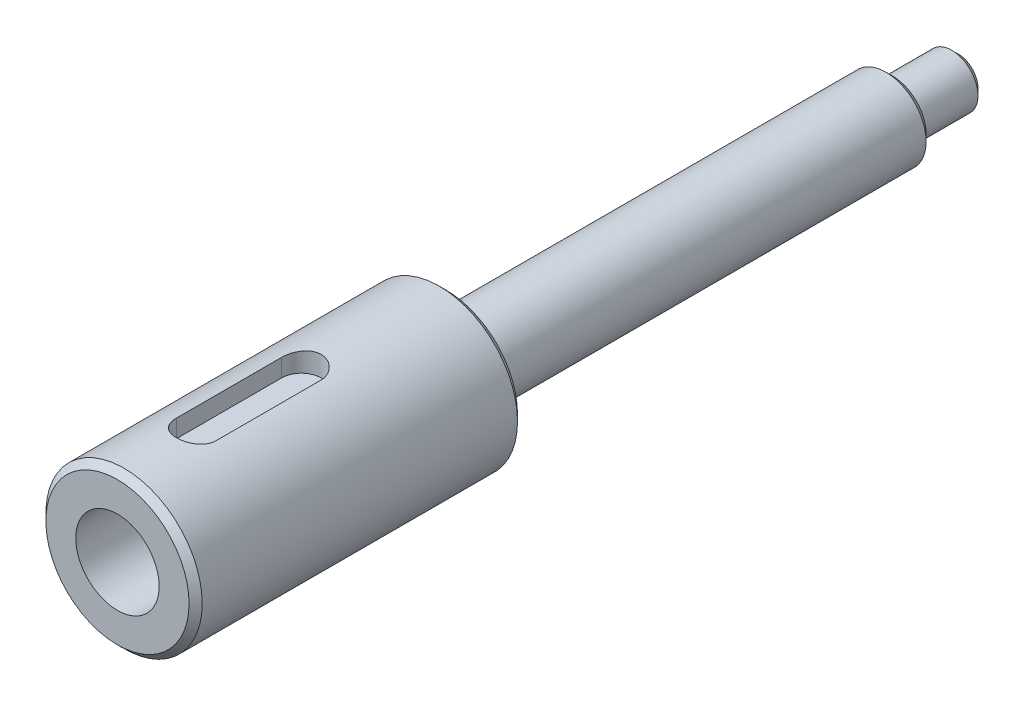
ISO-10303-21;
HEADER;
FILE_DESCRIPTION(('STEP AP214'),'2;1');
FILE_NAME('part.step','',(''),(''),'','','');
FILE_SCHEMA(('AUTOMOTIVE_DESIGN { 1 0 10303 214 1 1 1 1 }'));
ENDSEC;
DATA;
#1=APPLICATION_CONTEXT('core data for automotive mechanical design processes');
#2=APPLICATION_PROTOCOL_DEFINITION('international standard','automotive_design',2000,#1);
#3=PRODUCT_CONTEXT('',#1,'mechanical');
#4=PRODUCT('Part','Part','',(#3));
#5=PRODUCT_RELATED_PRODUCT_CATEGORY('part','',(#4));
#6=PRODUCT_DEFINITION_FORMATION('','',#4);
#7=PRODUCT_DEFINITION_CONTEXT('part definition',#1,'design');
#8=PRODUCT_DEFINITION('design','',#6,#7);
#9=PRODUCT_DEFINITION_SHAPE('','',#8);
#10=(LENGTH_UNIT() NAMED_UNIT(*) SI_UNIT(.MILLI.,.METRE.));
#11=(NAMED_UNIT(*) PLANE_ANGLE_UNIT() SI_UNIT($,.RADIAN.));
#12=(NAMED_UNIT(*) SI_UNIT($,.STERADIAN.) SOLID_ANGLE_UNIT());
#13=UNCERTAINTY_MEASURE_WITH_UNIT(LENGTH_MEASURE(1.E-05),#10,'distance_accuracy_value','');
#14=(GEOMETRIC_REPRESENTATION_CONTEXT(3) GLOBAL_UNCERTAINTY_ASSIGNED_CONTEXT((#13)) GLOBAL_UNIT_ASSIGNED_CONTEXT((#10,
#11,#12)) REPRESENTATION_CONTEXT('',''));
#15=CARTESIAN_POINT('',(0.,0.,0.));
#16=DIRECTION('',(0.,0.,1.));
#17=DIRECTION('',(1.,0.,0.));
#18=AXIS2_PLACEMENT_3D('',#15,#16,#17);
#19=CARTESIAN_POINT('',(0.,0.,-39.));
#20=DIRECTION('',(0.,0.,1.));
#21=DIRECTION('',(1.,0.,0.));
#22=AXIS2_PLACEMENT_3D('',#19,#20,#21);
#23=CYLINDRICAL_SURFACE('',#22,3.05);
#24=CARTESIAN_POINT('',(0.,0.,-33.5));
#25=DIRECTION('',(0.,0.,-1.));
#26=DIRECTION('',(-1.,0.,0.));
#27=AXIS2_PLACEMENT_3D('',#24,#25,#26);
#28=CIRCLE('',#27,3.05);
#29=CARTESIAN_POINT('',(-3.04999999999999,0.,-33.5));
#30=VERTEX_POINT('',#29);
#31=EDGE_CURVE('E12',#30,#30,#28,.F.);
#32=ORIENTED_EDGE('',*,*,#31,.T.);
#33=EDGE_LOOP('',(#32));
#34=FACE_BOUND('',#33,.T.);
#35=CARTESIAN_POINT('',(0.,0.,0.));
#36=DIRECTION('',(0.,0.,1.));
#37=DIRECTION('',(1.,0.,0.));
#38=AXIS2_PLACEMENT_3D('',#35,#36,#37);
#39=CIRCLE('',#38,3.05);
#40=CARTESIAN_POINT('',(3.04999999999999,0.,0.));
#41=VERTEX_POINT('',#40);
#42=EDGE_CURVE('E136',#41,#41,#39,.F.);
#43=ORIENTED_EDGE('',*,*,#42,.T.);
#44=EDGE_LOOP('',(#43));
#45=FACE_BOUND('',#44,.T.);
#46=ADVANCED_FACE('F53',(#34,#45),#23,.T.);
#47=CARTESIAN_POINT('',(0.,0.,0.));
#48=DIRECTION('',(0.,0.,1.));
#49=DIRECTION('',(1.,0.,0.));
#50=AXIS2_PLACEMENT_3D('',#47,#48,#49);
#51=PLANE('',#50);
#52=CARTESIAN_POINT('',(0.,0.,0.));
#53=DIRECTION('',(0.,0.,1.));
#54=DIRECTION('',(1.,0.,0.));
#55=AXIS2_PLACEMENT_3D('',#52,#53,#54);
#56=CIRCLE('',#55,5.45);
#57=CARTESIAN_POINT('',(5.44999999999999,0.,0.));
#58=VERTEX_POINT('',#57);
#59=EDGE_CURVE('E155',#58,#58,#56,.F.);
#60=ORIENTED_EDGE('',*,*,#59,.T.);
#61=EDGE_LOOP('',(#60));
#62=FACE_BOUND('',#61,.T.);
#63=ORIENTED_EDGE('',*,*,#42,.F.);
#64=EDGE_LOOP('',(#63));
#65=FACE_BOUND('',#64,.T.);
#66=ADVANCED_FACE('F220',(#62,#65),#51,.F.);
#67=CARTESIAN_POINT('',(0.,0.,25.));
#68=DIRECTION('',(0.,0.,-1.));
#69=DIRECTION('',(-1.,0.,0.));
#70=AXIS2_PLACEMENT_3D('',#67,#68,#69);
#71=CYLINDRICAL_SURFACE('',#70,5.95);
#72=CARTESIAN_POINT('',(-5.94999999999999,0.,3.5));
#73=CARTESIAN_POINT('',(-5.94999941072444,-0.0419493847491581,3.49999821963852));
#74=CARTESIAN_POINT('',(-5.94955168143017,-0.0839249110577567,3.49646863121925));
#75=CARTESIAN_POINT('',(-5.94780866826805,-0.166707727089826,3.4824442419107));
#76=CARTESIAN_POINT('',(-5.94651250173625,-0.207513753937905,3.47194218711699));
#77=CARTESIAN_POINT('',(-5.94321862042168,-0.28674715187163,3.44428737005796));
#78=CARTESIAN_POINT('',(-5.94122138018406,-0.325176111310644,3.42713910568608));
#79=CARTESIAN_POINT('',(-5.93674742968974,-0.398603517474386,3.38668852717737));
#80=CARTESIAN_POINT('',(-5.93427080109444,-0.433602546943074,3.36338726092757));
#81=CARTESIAN_POINT('',(-5.92909905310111,-0.499379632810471,3.3111527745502));
#82=CARTESIAN_POINT('',(-5.92640290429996,-0.530135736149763,3.28219200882));
#83=CARTESIAN_POINT('',(-5.92110427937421,-0.586364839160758,3.21951975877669));
#84=CARTESIAN_POINT('',(-5.91850180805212,-0.611837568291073,3.18580803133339));
#85=CARTESIAN_POINT('',(-5.91367506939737,-0.656858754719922,3.11444796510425));
#86=CARTESIAN_POINT('',(-5.91145212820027,-0.67638661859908,3.07678653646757));
#87=CARTESIAN_POINT('',(-5.90764973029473,-0.70883223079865,2.99868608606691));
#88=CARTESIAN_POINT('',(-5.90607024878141,-0.72175023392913,2.95824717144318));
#89=CARTESIAN_POINT('',(-5.90374344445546,-0.740542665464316,2.87596762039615));
#90=CARTESIAN_POINT('',(-5.90299174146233,-0.746454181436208,2.83413558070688));
#91=CARTESIAN_POINT('',(-5.90239220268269,-0.751180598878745,2.75006694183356));
#92=CARTESIAN_POINT('',(-5.90254432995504,-0.749995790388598,2.70783035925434));
#93=CARTESIAN_POINT('',(-5.90373125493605,-0.740593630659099,2.62441018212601));
#94=CARTESIAN_POINT('',(-5.90476092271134,-0.732417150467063,2.58322189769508));
#95=CARTESIAN_POINT('',(-5.90757890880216,-0.709327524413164,2.50280673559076));
#96=CARTESIAN_POINT('',(-5.90936724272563,-0.694414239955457,2.46357989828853));
#97=CARTESIAN_POINT('',(-5.91350687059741,-0.658230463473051,2.38807426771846));
#98=CARTESIAN_POINT('',(-5.91585973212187,-0.63694222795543,2.35180406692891));
#99=CARTESIAN_POINT('',(-5.92086209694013,-0.588625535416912,2.28333544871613));
#100=CARTESIAN_POINT('',(-5.92351161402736,-0.561596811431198,2.25113722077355));
#101=CARTESIAN_POINT('',(-5.92883155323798,-0.502339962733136,2.19148932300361));
#102=CARTESIAN_POINT('',(-5.93150199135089,-0.470076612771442,2.16407463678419));
#103=CARTESIAN_POINT('',(-5.93654545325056,-0.401387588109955,2.11504447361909));
#104=CARTESIAN_POINT('',(-5.93891847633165,-0.364961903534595,2.09342901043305));
#105=CARTESIAN_POINT('',(-5.94310124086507,-0.28895509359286,2.05661078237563));
#106=CARTESIAN_POINT('',(-5.94491078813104,-0.249372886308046,2.04141022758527));
#107=CARTESIAN_POINT('',(-5.94776095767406,-0.16818997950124,2.0178811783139));
#108=CARTESIAN_POINT('',(-5.94880161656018,-0.126589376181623,2.00955235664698));
#109=CARTESIAN_POINT('',(-5.94999199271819,-0.0428530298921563,2.00004858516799));
#110=CARTESIAN_POINT('',(-5.95014771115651,-0.000722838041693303,1.99882544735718));
#111=CARTESIAN_POINT('',(-5.94956686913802,0.0831419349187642,2.00344056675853));
#112=CARTESIAN_POINT('',(-5.94883032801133,0.124876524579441,2.00927867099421));
#113=CARTESIAN_POINT('',(-5.94655146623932,0.2066230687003,2.0278105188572));
#114=CARTESIAN_POINT('',(-5.94501184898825,0.246640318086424,2.04048126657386));
#115=CARTESIAN_POINT('',(-5.94129919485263,0.323981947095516,2.07229480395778));
#116=CARTESIAN_POINT('',(-5.93912613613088,0.361306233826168,2.091437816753));
#117=CARTESIAN_POINT('',(-5.93437388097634,0.432417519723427,2.13576893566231));
#118=CARTESIAN_POINT('',(-5.93179261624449,0.466184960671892,2.16098818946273));
#119=CARTESIAN_POINT('',(-5.92651911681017,0.529024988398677,2.21671186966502));
#120=CARTESIAN_POINT('',(-5.92382687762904,0.558097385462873,2.24721650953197));
#121=CARTESIAN_POINT('',(-5.918616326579,0.610893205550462,2.31285739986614));
#122=CARTESIAN_POINT('',(-5.91609911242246,0.63458467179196,2.34801945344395));
#123=CARTESIAN_POINT('',(-5.91154172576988,0.675725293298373,2.42185193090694));
#124=CARTESIAN_POINT('',(-5.90950154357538,0.693174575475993,2.46052228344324));
#125=CARTESIAN_POINT('',(-5.90613670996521,0.721283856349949,2.54017083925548));
#126=CARTESIAN_POINT('',(-5.90481016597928,0.731961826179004,2.5811426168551));
#127=CARTESIAN_POINT('',(-5.90301738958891,0.74628322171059,2.66431548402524));
#128=CARTESIAN_POINT('',(-5.90255111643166,0.749926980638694,2.70651651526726));
#129=CARTESIAN_POINT('',(-5.90253287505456,0.750070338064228,2.79063200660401));
#130=CARTESIAN_POINT('',(-5.9029744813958,0.746620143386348,2.8325463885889));
#131=CARTESIAN_POINT('',(-5.90470842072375,0.732779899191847,2.91519443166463));
#132=CARTESIAN_POINT('',(-5.90600075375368,0.72238984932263,2.95592809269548));
#133=CARTESIAN_POINT('',(-5.90928853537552,0.694980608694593,3.03505152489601));
#134=CARTESIAN_POINT('',(-5.91128372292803,0.677963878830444,3.07344216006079));
#135=CARTESIAN_POINT('',(-5.91575283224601,0.637789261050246,3.14683117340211));
#136=CARTESIAN_POINT('',(-5.91822676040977,0.61463129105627,3.18182950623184));
#137=CARTESIAN_POINT('',(-5.92339557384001,0.562645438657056,3.24769703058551));
#138=CARTESIAN_POINT('',(-5.92609184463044,0.533780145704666,3.27853658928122));
#139=CARTESIAN_POINT('',(-5.93138933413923,0.471277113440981,3.33495337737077));
#140=CARTESIAN_POINT('',(-5.93399053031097,0.43763825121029,3.36052936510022));
#141=CARTESIAN_POINT('',(-5.93881590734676,0.366393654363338,3.40577736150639));
#142=CARTESIAN_POINT('',(-5.94103859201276,0.328773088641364,3.42542616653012));
#143=CARTESIAN_POINT('',(-5.94484136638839,0.250759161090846,3.45809917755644));
#144=CARTESIAN_POINT('',(-5.94642215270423,0.210368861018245,3.4711305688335));
#145=CARTESIAN_POINT('',(-5.94838273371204,0.141475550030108,3.48708581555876));
#146=CARTESIAN_POINT('',(-5.94898624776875,0.113406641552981,3.49192165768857));
#147=CARTESIAN_POINT('',(-5.94979507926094,0.0568958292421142,3.4983793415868));
#148=CARTESIAN_POINT('',(-5.95000039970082,0.028453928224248,3.50000120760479));
#149=CARTESIAN_POINT('',(-5.94999999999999,0.,3.5));
#150=B_SPLINE_CURVE_WITH_KNOTS('',3,(#72,#73,#74,#75,#76,#77,#78,#79,#80,#81,#82,#83,#84,#85,
#86,#87,#88,#89,#90,#91,#92,#93,#94,#95,#96,#97,#98,#99,#100,#101,#102,#103,#104,#105,#106,#107,
#108,#109,#110,#111,#112,#113,#114,#115,#116,#117,#118,#119,#120,#121,#122,#123,#124,#125,#126,
#127,#128,#129,#130,#131,#132,#133,#134,#135,#136,#137,#138,#139,#140,#141,#142,#143,#144,#145,
#146,#147,#148,#149),.UNSPECIFIED.,.T.,.F.,(4,2,2,2,2,2,2,2,2,2,2,2,2,2,2,2,2,2,2,2,2,2,2,2,2,2,
2,2,2,2,2,2,2,2,2,2,2,2,4),(0.,0.125744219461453,0.251619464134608,0.377409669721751,
0.503178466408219,0.629575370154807,0.755978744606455,0.882815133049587,1.00964663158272,
1.13580372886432,1.26195566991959,1.38737516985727,1.51279725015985,1.63857171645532,
1.76435203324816,1.89101682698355,2.01768192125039,2.14439061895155,2.27109328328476,
2.39693568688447,2.52277536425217,2.64819413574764,2.77361723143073,2.89969748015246,
3.0257828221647,3.15259845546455,3.2794115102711,3.4058865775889,3.53235565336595,
3.65793273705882,3.78350982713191,3.90904032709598,4.03457250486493,4.16095656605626,
4.28737040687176,4.41427289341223,4.5410372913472,4.62632922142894,4.71162050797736),.UNSPECIFIED.);
#151=CARTESIAN_POINT('',(-5.94999999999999,0.,3.5));
#152=VERTEX_POINT('',#151);
#153=EDGE_CURVE('E118',#152,#152,#150,.T.);
#154=ORIENTED_EDGE('',*,*,#153,.T.);
#155=EDGE_LOOP('',(#154));
#156=FACE_BOUND('',#155,.T.);
#157=DIRECTION('',(0.,0.,-1.));
#158=VECTOR('',#157,1.);
#159=CARTESIAN_POINT('',(1.5,5.75782076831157,25.));
#160=LINE('',#159,#158);
#161=CARTESIAN_POINT('',(1.5,5.75782076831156,11.));
#162=VERTEX_POINT('',#161);
#163=CARTESIAN_POINT('',(1.49999999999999,5.75782076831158,19.));
#164=VERTEX_POINT('',#163);
#165=EDGE_CURVE('E158',#162,#164,#160,.F.);
#166=ORIENTED_EDGE('',*,*,#165,.T.);
#167=CARTESIAN_POINT('',(0.,5.95,20.5));
#168=CARTESIAN_POINT('',(-0.0828533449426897,5.94999861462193,20.4999977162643));
#169=CARTESIAN_POINT('',(-0.165732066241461,5.94825219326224,20.4931122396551));
#170=CARTESIAN_POINT('',(-0.329112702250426,5.94145464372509,20.4657944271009));
#171=CARTESIAN_POINT('',(-0.409613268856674,5.93640167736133,20.445354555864));
#172=CARTESIAN_POINT('',(-0.565854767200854,5.92355035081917,20.3916266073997));
#173=CARTESIAN_POINT('',(-0.641601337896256,5.91575531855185,20.3583540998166));
#174=CARTESIAN_POINT('',(-0.786437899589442,5.89824924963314,20.2799605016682));
#175=CARTESIAN_POINT('',(-0.855527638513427,5.88853814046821,20.2348389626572));
#176=CARTESIAN_POINT('',(-0.986534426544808,5.86802636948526,20.1330313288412));
#177=CARTESIAN_POINT('',(-1.04829241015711,5.85720867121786,20.0761439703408));
#178=CARTESIAN_POINT('',(-1.1614999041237,5.83581565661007,19.9528503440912));
#179=CARTESIAN_POINT('',(-1.2129482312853,5.82524036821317,19.8864429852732));
#180=CARTESIAN_POINT('',(-1.30482744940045,5.80535748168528,19.7447550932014));
#181=CARTESIAN_POINT('',(-1.3450797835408,5.79607149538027,19.6693554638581));
#182=CARTESIAN_POINT('',(-1.41227590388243,5.78006730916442,19.5125876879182));
#183=CARTESIAN_POINT('',(-1.43922185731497,5.77334869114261,19.4312205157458));
#184=CARTESIAN_POINT('',(-1.47849647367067,5.76341514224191,19.2665780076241));
#185=CARTESIAN_POINT('',(-1.49111143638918,5.76013169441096,19.1833751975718));
#186=CARTESIAN_POINT('',(-1.50225785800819,5.75723520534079,19.0159744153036));
#187=CARTESIAN_POINT('',(-1.50079164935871,5.75762155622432,18.9317766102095));
#188=CARTESIAN_POINT('',(-1.4840456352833,5.76195945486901,18.766975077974));
#189=CARTESIAN_POINT('',(-1.46910763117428,5.76582278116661,18.6863339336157));
#190=CARTESIAN_POINT('',(-1.42638757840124,5.77653865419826,18.5287409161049));
#191=CARTESIAN_POINT('',(-1.3986046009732,5.7833914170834,18.4517893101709));
#192=CARTESIAN_POINT('',(-1.33069355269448,5.79939458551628,18.3028463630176));
#193=CARTESIAN_POINT('',(-1.29044195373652,5.808567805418,18.2309138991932));
#194=CARTESIAN_POINT('',(-1.19882262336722,5.82816549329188,18.094702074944));
#195=CARTESIAN_POINT('',(-1.14745291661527,5.83859018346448,18.0304240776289));
#196=CARTESIAN_POINT('',(-1.03328788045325,5.85988714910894,17.9093877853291));
#197=CARTESIAN_POINT('',(-0.970204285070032,5.87076363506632,17.8529017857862));
#198=CARTESIAN_POINT('',(-0.835329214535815,5.89146611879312,17.7512583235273));
#199=CARTESIAN_POINT('',(-0.763537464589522,5.90129208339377,17.706101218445));
#200=CARTESIAN_POINT('',(-0.612891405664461,5.91883666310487,17.628294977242));
#201=CARTESIAN_POINT('',(-0.534012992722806,5.92654769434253,17.5956906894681));
#202=CARTESIAN_POINT('',(-0.371656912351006,5.93893847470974,17.5442809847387));
#203=CARTESIAN_POINT('',(-0.288180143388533,5.94361881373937,17.5254728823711));
#204=CARTESIAN_POINT('',(-0.121324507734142,5.94933333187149,17.502606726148));
#205=CARTESIAN_POINT('',(-0.0379995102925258,5.95045913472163,17.4981779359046));
#206=CARTESIAN_POINT('',(0.128201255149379,5.94919899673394,17.5031784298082));
#207=CARTESIAN_POINT('',(0.211077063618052,5.94681337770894,17.5126064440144));
#208=CARTESIAN_POINT('',(0.372734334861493,5.93885722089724,17.5447475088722));
#209=CARTESIAN_POINT('',(0.451558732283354,5.93333533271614,17.5672577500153));
#210=CARTESIAN_POINT('',(0.604308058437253,5.919729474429,17.6246921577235));
#211=CARTESIAN_POINT('',(0.678232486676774,5.9116452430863,17.6596175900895));
#212=CARTESIAN_POINT('',(0.820554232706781,5.89359258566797,17.7416056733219));
#213=CARTESIAN_POINT('',(0.888828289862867,5.88359289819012,17.7888752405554));
#214=CARTESIAN_POINT('',(1.01660653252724,5.86286691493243,17.8939458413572));
#215=CARTESIAN_POINT('',(1.07610917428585,5.85214049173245,17.9517487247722));
#216=CARTESIAN_POINT('',(1.18618757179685,5.83083925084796,18.0779676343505));
#217=CARTESIAN_POINT('',(1.23650306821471,5.8202749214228,18.146612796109));
#218=CARTESIAN_POINT('',(1.32490101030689,5.80079254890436,18.2915904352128));
#219=CARTESIAN_POINT('',(1.36298399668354,5.79187443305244,18.3679225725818));
#220=CARTESIAN_POINT('',(1.42555153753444,5.7767931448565,18.5257005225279));
#221=CARTESIAN_POINT('',(1.45011659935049,5.77061370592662,18.6071127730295));
#222=CARTESIAN_POINT('',(1.48516081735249,5.76169510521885,18.7730917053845));
#223=CARTESIAN_POINT('',(1.49564311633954,5.75895517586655,18.8576576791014));
#224=CARTESIAN_POINT('',(1.50205796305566,5.7572850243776,19.0248932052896));
#225=CARTESIAN_POINT('',(1.4984067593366,5.75824580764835,19.1075459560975));
#226=CARTESIAN_POINT('',(1.47761248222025,5.76361643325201,19.2710164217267));
#227=CARTESIAN_POINT('',(1.46046968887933,5.76802620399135,19.3518341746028));
#228=CARTESIAN_POINT('',(1.41340795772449,5.77973666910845,19.5088791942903));
#229=CARTESIAN_POINT('',(1.38356833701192,5.78701939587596,19.5851316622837));
#230=CARTESIAN_POINT('',(1.31202256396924,5.80365744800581,19.7316028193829));
#231=CARTESIAN_POINT('',(1.27031473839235,5.81301306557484,19.8018206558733));
#232=CARTESIAN_POINT('',(1.17491686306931,5.83305252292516,19.9362377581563));
#233=CARTESIAN_POINT('',(1.12093857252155,5.84376499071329,20.000228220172));
#234=CARTESIAN_POINT('',(1.00309206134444,5.86514161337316,20.118378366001));
#235=CARTESIAN_POINT('',(0.939221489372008,5.8758057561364,20.1725357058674));
#236=CARTESIAN_POINT('',(0.801977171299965,5.89611968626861,20.2704603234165));
#237=CARTESIAN_POINT('',(0.728449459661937,5.90574705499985,20.3140168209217));
#238=CARTESIAN_POINT('',(0.574878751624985,5.92266516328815,20.388081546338));
#239=CARTESIAN_POINT('',(0.494840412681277,5.92995755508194,20.4185990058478));
#240=CARTESIAN_POINT('',(0.345802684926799,5.94032242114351,20.4612563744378));
#241=CARTESIAN_POINT('',(0.277505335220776,5.94392640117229,20.4757535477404));
#242=CARTESIAN_POINT('',(0.139477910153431,5.9487656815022,20.4951259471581));
#243=CARTESIAN_POINT('',(0.069747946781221,5.95000116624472,20.5000019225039));
#244=CARTESIAN_POINT('',(0.,5.95,20.5));
#245=B_SPLINE_CURVE_WITH_KNOTS('',3,(#167,#168,#169,#170,#171,#172,#173,#174,#175,#176,#177,
#178,#179,#180,#181,#182,#183,#184,#185,#186,#187,#188,#189,#190,#191,#192,#193,#194,#195,#196,
#197,#198,#199,#200,#201,#202,#203,#204,#205,#206,#207,#208,#209,#210,#211,#212,#213,#214,#215,
#216,#217,#218,#219,#220,#221,#222,#223,#224,#225,#226,#227,#228,#229,#230,#231,#232,#233,#234,
#235,#236,#237,#238,#239,#240,#241,#242,#243,#244),.UNSPECIFIED.,.T.,.F.,(4,2,2,2,2,2,2,2,2,2,2,
2,2,2,2,2,2,2,2,2,2,2,2,2,2,2,2,2,2,2,2,2,2,2,2,2,2,2,4),(0.,0.248304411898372,
0.496746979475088,0.744889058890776,0.993040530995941,1.24585216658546,1.49869279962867,
1.75536063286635,2.01198664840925,2.26339038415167,2.51475247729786,2.75991115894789,
3.00508756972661,3.25277516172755,3.50050679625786,3.75542631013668,4.01035387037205,
4.26618395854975,4.52196423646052,4.77109516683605,5.02020326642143,5.26554880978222,
5.51091937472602,5.76070124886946,6.01052703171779,6.26659631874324,6.52265428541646,
6.77717029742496,7.03162950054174,7.27865240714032,7.5256701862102,7.77116699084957,
8.01669842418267,8.2687364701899,8.5208345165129,8.77759696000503,9.03417731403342,
9.24322224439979,9.45225089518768),.UNSPECIFIED.);
#246=CARTESIAN_POINT('',(-1.5,5.75782076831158,19.));
#247=VERTEX_POINT('',#246);
#248=EDGE_CURVE('E189',#164,#247,#245,.T.);
#249=ORIENTED_EDGE('',*,*,#248,.T.);
#250=DIRECTION('',(0.,0.,-1.));
#251=VECTOR('',#250,1.);
#252=CARTESIAN_POINT('',(-1.49999999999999,5.75782076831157,25.));
#253=LINE('',#252,#251);
#254=CARTESIAN_POINT('',(-1.5,5.75782076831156,11.));
#255=VERTEX_POINT('',#254);
#256=EDGE_CURVE('E168',#247,#255,#253,.T.);
#257=ORIENTED_EDGE('',*,*,#256,.T.);
#258=CARTESIAN_POINT('',(-1.5,5.75782076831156,11.));
#259=CARTESIAN_POINT('',(-1.50000051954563,5.75781794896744,10.9585175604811));
#260=CARTESIAN_POINT('',(-1.49827811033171,5.75826963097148,10.9170556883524));
#261=CARTESIAN_POINT('',(-1.49141196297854,5.76005287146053,10.8344422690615));
#262=CARTESIAN_POINT('',(-1.48626880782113,5.76138428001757,10.7932906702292));
#263=CARTESIAN_POINT('',(-1.46578353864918,5.76664453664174,10.6709191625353));
#264=CARTESIAN_POINT('',(-1.44538528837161,5.77183974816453,10.5905405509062));
#265=CARTESIAN_POINT('',(-1.39176749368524,5.78500082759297,10.4344906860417));
#266=CARTESIAN_POINT('',(-1.35854927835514,5.79296640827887,10.3588189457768));
#267=CARTESIAN_POINT('',(-1.28027492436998,5.81076604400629,10.2140837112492));
#268=CARTESIAN_POINT('',(-1.23521552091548,5.82060061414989,10.1450220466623));
#269=CARTESIAN_POINT('',(-1.13347307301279,5.84127381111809,10.013968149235));
#270=CARTESIAN_POINT('',(-1.0765752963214,5.85212860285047,9.95214521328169));
#271=CARTESIAN_POINT('',(-0.953228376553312,5.87347999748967,9.83880588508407));
#272=CARTESIAN_POINT('',(-0.886777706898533,5.88397654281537,9.78729114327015));
#273=CARTESIAN_POINT('',(-0.745045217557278,5.90360822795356,9.69533814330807));
#274=CARTESIAN_POINT('',(-0.669651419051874,5.91272192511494,9.65506751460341));
#275=CARTESIAN_POINT('',(-0.512900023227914,5.92837481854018,9.58783762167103));
#276=CARTESIAN_POINT('',(-0.431543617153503,5.93491452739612,9.56087570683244));
#277=CARTESIAN_POINT('',(-0.266949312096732,5.94456823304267,9.52157211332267));
#278=CARTESIAN_POINT('',(-0.183784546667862,5.94774993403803,9.50894108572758));
#279=CARTESIAN_POINT('',(-0.0164577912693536,5.95056519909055,9.49774920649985));
#280=CARTESIAN_POINT('',(0.0677040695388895,5.95019921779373,9.49918655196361));
#281=CARTESIAN_POINT('',(0.232624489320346,5.9460105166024,9.51588359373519));
#282=CARTESIAN_POINT('',(0.313416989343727,5.94226599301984,9.53083062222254));
#283=CARTESIAN_POINT('',(0.471307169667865,5.93183220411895,9.57361969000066));
#284=CARTESIAN_POINT('',(0.548404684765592,5.92514280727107,9.60146230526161));
#285=CARTESIAN_POINT('',(0.697538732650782,5.90945163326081,9.6695038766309));
#286=CARTESIAN_POINT('',(0.769522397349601,5.90042922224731,9.70981375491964));
#287=CARTESIAN_POINT('',(0.905811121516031,5.8810502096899,9.80156060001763));
#288=CARTESIAN_POINT('',(0.970114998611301,5.87069340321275,9.85299927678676));
#289=CARTESIAN_POINT('',(1.09107879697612,5.8494381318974,9.96721055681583));
#290=CARTESIAN_POINT('',(1.1474809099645,5.83853260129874,10.0302551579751));
#291=CARTESIAN_POINT('',(1.24898346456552,5.81766568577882,10.1650402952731));
#292=CARTESIAN_POINT('',(1.29408080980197,5.80770455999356,10.2367832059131));
#293=CARTESIAN_POINT('',(1.37186606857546,5.78982652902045,10.3874524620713));
#294=CARTESIAN_POINT('',(1.4044839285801,5.78192124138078,10.4664163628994));
#295=CARTESIAN_POINT('',(1.45585909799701,5.76920154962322,10.628908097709));
#296=CARTESIAN_POINT('',(1.47463713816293,5.76438252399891,10.7124289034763));
#297=CARTESIAN_POINT('',(1.49078909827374,5.760213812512,10.8305627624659));
#298=CARTESIAN_POINT('',(1.49424374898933,5.75931782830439,10.8643797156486));
#299=CARTESIAN_POINT('',(1.49884662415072,5.75812155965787,10.9321257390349));
#300=CARTESIAN_POINT('',(1.49999857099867,5.75782031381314,10.966054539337));
#301=CARTESIAN_POINT('',(1.5,5.75782076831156,11.));
#302=B_SPLINE_CURVE_WITH_KNOTS('',3,(#258,#259,#260,#261,#262,#263,#264,#265,#266,#267,#268,
#269,#270,#271,#272,#273,#274,#275,#276,#277,#278,#279,#280,#281,#282,#283,#284,#285,#286,#287,
#288,#289,#290,#291,#292,#293,#294,#295,#296,#297,#298,#299,#300,#301),.UNSPECIFIED.,.F.,.F.,(4,
2,2,2,2,2,2,2,2,2,2,2,2,2,2,2,2,2,2,2,2,4),(0.,0.124368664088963,0.248716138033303,
0.49669459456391,0.74464734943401,0.992668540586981,1.24565730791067,1.49868654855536,
1.75530791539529,2.01187815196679,2.26317037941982,2.51443040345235,2.76002011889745,
3.00562080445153,3.25347273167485,3.50136276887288,3.75604692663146,4.01080076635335,
4.26696438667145,4.52274351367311,4.62469085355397,4.72647325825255),.UNSPECIFIED.);
#303=EDGE_CURVE('E161',#255,#162,#302,.T.);
#304=ORIENTED_EDGE('',*,*,#303,.T.);
#305=EDGE_LOOP('',(#166,#249,#257,#304));
#306=FACE_BOUND('',#305,.T.);
#307=CARTESIAN_POINT('',(0.,0.,24.5));
#308=DIRECTION('',(0.,0.,1.));
#309=DIRECTION('',(1.,0.,0.));
#310=AXIS2_PLACEMENT_3D('',#307,#308,#309);
#311=CIRCLE('',#310,5.95);
#312=CARTESIAN_POINT('',(5.95,0.,24.5));
#313=VERTEX_POINT('',#312);
#314=EDGE_CURVE('E152',#313,#313,#311,.F.);
#315=ORIENTED_EDGE('',*,*,#314,.T.);
#316=EDGE_LOOP('',(#315));
#317=FACE_BOUND('',#316,.T.);
#318=CARTESIAN_POINT('',(0.,0.,0.5));
#319=DIRECTION('',(0.,0.,1.));
#320=DIRECTION('',(1.,0.,0.));
#321=AXIS2_PLACEMENT_3D('',#318,#319,#320);
#322=CIRCLE('',#321,5.95);
#323=CARTESIAN_POINT('',(5.94999999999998,0.,0.5));
#324=VERTEX_POINT('',#323);
#325=EDGE_CURVE('E149',#324,#324,#322,.T.);
#326=ORIENTED_EDGE('',*,*,#325,.T.);
#327=EDGE_LOOP('',(#326));
#328=FACE_BOUND('',#327,.T.);
#329=ADVANCED_FACE('F55',(#156,#306,#317,#328),#71,.T.);
#330=CARTESIAN_POINT('',(0.,0.,25.));
#331=DIRECTION('',(0.,0.,1.));
#332=DIRECTION('',(1.,0.,0.));
#333=AXIS2_PLACEMENT_3D('',#330,#331,#332);
#334=PLANE('',#333);
#335=CARTESIAN_POINT('',(0.,0.,25.));
#336=DIRECTION('',(0.,0.,1.));
#337=DIRECTION('',(1.,0.,0.));
#338=AXIS2_PLACEMENT_3D('',#335,#336,#337);
#339=CIRCLE('',#338,3.175);
#340=CARTESIAN_POINT('',(3.17500000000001,0.,25.));
#341=VERTEX_POINT('',#340);
#342=EDGE_CURVE('E111',#341,#341,#339,.T.);
#343=ORIENTED_EDGE('',*,*,#342,.F.);
#344=EDGE_LOOP('',(#343));
#345=FACE_BOUND('',#344,.T.);
#346=CARTESIAN_POINT('',(0.,0.,25.));
#347=DIRECTION('',(0.,0.,1.));
#348=DIRECTION('',(1.,0.,0.));
#349=AXIS2_PLACEMENT_3D('',#346,#347,#348);
#350=CIRCLE('',#349,5.45);
#351=CARTESIAN_POINT('',(5.45000000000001,0.,25.));
#352=VERTEX_POINT('',#351);
#353=EDGE_CURVE('E146',#352,#352,#350,.T.);
#354=ORIENTED_EDGE('',*,*,#353,.T.);
#355=EDGE_LOOP('',(#354));
#356=FACE_BOUND('',#355,.T.);
#357=ADVANCED_FACE('F230',(#345,#356),#334,.T.);
#358=CARTESIAN_POINT('',(0.,0.,25.));
#359=DIRECTION('',(0.,0.,-1.));
#360=DIRECTION('',(-1.,0.,0.));
#361=AXIS2_PLACEMENT_3D('',#358,#359,#360);
#362=CONICAL_SURFACE('',#361,5.45,0.785398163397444);
#363=ORIENTED_EDGE('',*,*,#314,.F.);
#364=EDGE_LOOP('',(#363));
#365=FACE_BOUND('',#364,.T.);
#366=ORIENTED_EDGE('',*,*,#353,.F.);
#367=EDGE_LOOP('',(#366));
#368=FACE_BOUND('',#367,.T.);
#369=ADVANCED_FACE('F232',(#365,#368),#362,.T.);
#370=CARTESIAN_POINT('',(0.,0.,0.5));
#371=DIRECTION('',(0.,0.,1.));
#372=DIRECTION('',(1.,0.,0.));
#373=AXIS2_PLACEMENT_3D('',#370,#371,#372);
#374=CONICAL_SURFACE('',#373,5.95,0.785398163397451);
#375=ORIENTED_EDGE('',*,*,#59,.F.);
#376=EDGE_LOOP('',(#375));
#377=FACE_BOUND('',#376,.T.);
#378=ORIENTED_EDGE('',*,*,#325,.F.);
#379=EDGE_LOOP('',(#378));
#380=FACE_BOUND('',#379,.T.);
#381=ADVANCED_FACE('F186',(#377,#380),#374,.T.);
#382=CARTESIAN_POINT('',(0.,4.39999999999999,19.));
#383=DIRECTION('',(0.,1.,0.));
#384=DIRECTION('',(0.,0.,1.));
#385=AXIS2_PLACEMENT_3D('',#382,#383,#384);
#386=CYLINDRICAL_SURFACE('',#385,1.5);
#387=DIRECTION('',(0.,1.,0.));
#388=VECTOR('',#387,1.);
#389=CARTESIAN_POINT('',(1.49999999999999,4.39999999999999,19.));
#390=LINE('',#389,#388);
#391=CARTESIAN_POINT('',(1.49999999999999,4.39999999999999,19.));
#392=VERTEX_POINT('',#391);
#393=EDGE_CURVE('E78',#392,#164,#390,.T.);
#394=ORIENTED_EDGE('',*,*,#393,.F.);
#395=CARTESIAN_POINT('',(0.,4.39999999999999,19.));
#396=DIRECTION('',(0.,1.,0.));
#397=DIRECTION('',(0.,0.,1.));
#398=AXIS2_PLACEMENT_3D('',#395,#396,#397);
#399=CIRCLE('',#398,1.5);
#400=CARTESIAN_POINT('',(-1.49999999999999,4.4,19.));
#401=VERTEX_POINT('',#400);
#402=EDGE_CURVE('E115',#401,#392,#399,.T.);
#403=ORIENTED_EDGE('',*,*,#402,.F.);
#404=DIRECTION('',(0.,1.,0.));
#405=VECTOR('',#404,1.);
#406=CARTESIAN_POINT('',(-1.49999999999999,4.4,19.));
#407=LINE('',#406,#405);
#408=EDGE_CURVE('E133',#401,#247,#407,.T.);
#409=ORIENTED_EDGE('',*,*,#408,.T.);
#410=ORIENTED_EDGE('',*,*,#248,.F.);
#411=EDGE_LOOP('',(#394,#403,#409,#410));
#412=FACE_BOUND('',#411,.T.);
#413=ADVANCED_FACE('F182',(#412),#386,.F.);
#414=CARTESIAN_POINT('',(-1.49999999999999,4.4,19.));
#415=DIRECTION('',(-1.,0.,0.));
#416=DIRECTION('',(0.,0.,1.));
#417=AXIS2_PLACEMENT_3D('',#414,#415,#416);
#418=PLANE('',#417);
#419=ORIENTED_EDGE('',*,*,#408,.F.);
#420=DIRECTION('',(0.,0.,1.));
#421=VECTOR('',#420,1.);
#422=CARTESIAN_POINT('',(-1.49999999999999,4.4,19.));
#423=LINE('',#422,#421);
#424=CARTESIAN_POINT('',(-1.5,4.4,11.));
#425=VERTEX_POINT('',#424);
#426=EDGE_CURVE('E130',#425,#401,#423,.T.);
#427=ORIENTED_EDGE('',*,*,#426,.F.);
#428=DIRECTION('',(0.,1.,0.));
#429=VECTOR('',#428,1.);
#430=CARTESIAN_POINT('',(-1.5,4.4,11.));
#431=LINE('',#430,#429);
#432=EDGE_CURVE('E137',#425,#255,#431,.T.);
#433=ORIENTED_EDGE('',*,*,#432,.T.);
#434=ORIENTED_EDGE('',*,*,#256,.F.);
#435=EDGE_LOOP('',(#419,#427,#433,#434));
#436=FACE_BOUND('',#435,.T.);
#437=ADVANCED_FACE('F176',(#436),#418,.F.);
#438=CARTESIAN_POINT('',(0.,4.40000000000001,11.));
#439=DIRECTION('',(0.,1.,0.));
#440=DIRECTION('',(0.,0.,1.));
#441=AXIS2_PLACEMENT_3D('',#438,#439,#440);
#442=CYLINDRICAL_SURFACE('',#441,1.5);
#443=ORIENTED_EDGE('',*,*,#432,.F.);
#444=CARTESIAN_POINT('',(0.,4.40000000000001,11.));
#445=DIRECTION('',(0.,1.,0.));
#446=DIRECTION('',(0.,0.,1.));
#447=AXIS2_PLACEMENT_3D('',#444,#445,#446);
#448=CIRCLE('',#447,1.5);
#449=CARTESIAN_POINT('',(1.5,4.39999999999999,11.));
#450=VERTEX_POINT('',#449);
#451=EDGE_CURVE('E127',#450,#425,#448,.T.);
#452=ORIENTED_EDGE('',*,*,#451,.F.);
#453=DIRECTION('',(0.,1.,0.));
#454=VECTOR('',#453,1.);
#455=CARTESIAN_POINT('',(1.5,4.39999999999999,11.));
#456=LINE('',#455,#454);
#457=EDGE_CURVE('E140',#450,#162,#456,.T.);
#458=ORIENTED_EDGE('',*,*,#457,.T.);
#459=ORIENTED_EDGE('',*,*,#303,.F.);
#460=EDGE_LOOP('',(#443,#452,#458,#459));
#461=FACE_BOUND('',#460,.T.);
#462=ADVANCED_FACE('F170',(#461),#442,.F.);
#463=CARTESIAN_POINT('',(1.49999999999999,4.39999999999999,19.));
#464=DIRECTION('',(1.,0.,0.));
#465=DIRECTION('',(0.,0.,-1.));
#466=AXIS2_PLACEMENT_3D('',#463,#464,#465);
#467=PLANE('',#466);
#468=ORIENTED_EDGE('',*,*,#457,.F.);
#469=DIRECTION('',(0.,0.,-1.));
#470=VECTOR('',#469,1.);
#471=CARTESIAN_POINT('',(1.49999999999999,4.39999999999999,19.));
#472=LINE('',#471,#470);
#473=EDGE_CURVE('E124',#392,#450,#472,.T.);
#474=ORIENTED_EDGE('',*,*,#473,.F.);
#475=ORIENTED_EDGE('',*,*,#393,.T.);
#476=ORIENTED_EDGE('',*,*,#165,.F.);
#477=EDGE_LOOP('',(#468,#474,#475,#476));
#478=FACE_BOUND('',#477,.T.);
#479=ADVANCED_FACE('F175',(#478),#467,.F.);
#480=CARTESIAN_POINT('',(0.,4.39999999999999,19.));
#481=DIRECTION('',(0.,1.,0.));
#482=DIRECTION('',(0.,0.,1.));
#483=AXIS2_PLACEMENT_3D('',#480,#481,#482);
#484=PLANE('',#483);
#485=ORIENTED_EDGE('',*,*,#402,.T.);
#486=ORIENTED_EDGE('',*,*,#473,.T.);
#487=ORIENTED_EDGE('',*,*,#451,.T.);
#488=ORIENTED_EDGE('',*,*,#426,.T.);
#489=EDGE_LOOP('',(#485,#486,#487,#488));
#490=FACE_BOUND('',#489,.T.);
#491=ADVANCED_FACE('F181',(#490),#484,.T.);
#492=CARTESIAN_POINT('',(0.,0.,25.));
#493=DIRECTION('',(0.,0.,1.));
#494=DIRECTION('',(1.,0.,0.));
#495=AXIS2_PLACEMENT_3D('',#492,#493,#494);
#496=CYLINDRICAL_SURFACE('',#495,3.175);
#497=CARTESIAN_POINT('',(0.,0.,3.5));
#498=DIRECTION('',(0.,0.,1.));
#499=DIRECTION('',(1.,0.,0.));
#500=AXIS2_PLACEMENT_3D('',#497,#498,#499);
#501=CIRCLE('',#500,3.175);
#502=CARTESIAN_POINT('',(-3.17500000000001,0.,3.5));
#503=VERTEX_POINT('',#502);
#504=EDGE_CURVE('E109',#503,#503,#501,.T.);
#505=ORIENTED_EDGE('',*,*,#504,.F.);
#506=EDGE_LOOP('',(#505));
#507=FACE_BOUND('',#506,.T.);
#508=ORIENTED_EDGE('',*,*,#342,.T.);
#509=EDGE_LOOP('',(#508));
#510=FACE_BOUND('',#509,.T.);
#511=ADVANCED_FACE('F106',(#507,#510),#496,.F.);
#512=CARTESIAN_POINT('',(0.,0.,3.5));
#513=DIRECTION('',(0.,0.,1.));
#514=DIRECTION('',(1.,0.,0.));
#515=AXIS2_PLACEMENT_3D('',#512,#513,#514);
#516=CONICAL_SURFACE('',#515,3.175,1.02974425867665);
#517=CARTESIAN_POINT('',(0.,0.,1.59226753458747));
#518=VERTEX_POINT('',#517);
#519=VERTEX_LOOP('',#518);
#520=FACE_BOUND('',#519,.T.);
#521=ORIENTED_EDGE('',*,*,#504,.T.);
#522=CARTESIAN_POINT('',(-2.88902189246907,-0.451067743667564,3.34919779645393));
#523=CARTESIAN_POINT('',(-2.92061532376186,-0.428880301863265,3.36589757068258));
#524=CARTESIAN_POINT('',(-2.95122350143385,-0.404871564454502,3.38206185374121));
#525=CARTESIAN_POINT('',(-3.00935768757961,-0.352416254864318,3.41274128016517));
#526=CARTESIAN_POINT('',(-3.03688918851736,-0.323977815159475,3.42725936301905));
#527=CARTESIAN_POINT('',(-3.07777748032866,-0.273172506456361,3.44880936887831));
#528=CARTESIAN_POINT('',(-3.09264284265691,-0.252371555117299,3.45664098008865));
#529=CARTESIAN_POINT('',(-3.11952093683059,-0.208518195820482,3.47079750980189));
#530=CARTESIAN_POINT('',(-3.13153807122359,-0.185469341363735,3.47712475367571));
#531=CARTESIAN_POINT('',(-3.14968850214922,-0.142099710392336,3.48667956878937));
#532=CARTESIAN_POINT('',(-3.15651790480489,-0.12215541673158,3.4902739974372));
#533=CARTESIAN_POINT('',(-3.16715040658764,-0.0812584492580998,3.49586960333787));
#534=CARTESIAN_POINT('',(-3.17095665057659,-0.0603068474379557,3.49787243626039));
#535=CARTESIAN_POINT('',(-3.17517080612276,-0.0178524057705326,3.50008989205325));
#536=CARTESIAN_POINT('',(-3.17556132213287,0.00365269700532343,3.50029536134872));
#537=CARTESIAN_POINT('',(-3.17285234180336,0.0463812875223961,3.49886994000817));
#538=CARTESIAN_POINT('',(-3.1697515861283,0.0676046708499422,3.49723838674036));
#539=CARTESIAN_POINT('',(-3.16072650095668,0.107650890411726,3.49248893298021));
#540=CARTESIAN_POINT('',(-3.15501709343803,0.126537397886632,3.48948416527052));
#541=CARTESIAN_POINT('',(-3.14130622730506,0.163200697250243,3.48226711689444));
#542=CARTESIAN_POINT('',(-3.13330399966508,0.180977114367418,3.4780544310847));
#543=CARTESIAN_POINT('',(-3.1095522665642,0.226639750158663,3.46554785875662));
#544=CARTESIAN_POINT('',(-3.09217782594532,0.253443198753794,3.45639673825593));
#545=CARTESIAN_POINT('',(-3.05400578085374,0.303733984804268,3.43628183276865));
#546=CARTESIAN_POINT('',(-3.03319701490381,0.327210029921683,3.42531213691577));
#547=CARTESIAN_POINT('',(-2.97228308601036,0.388299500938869,3.39318196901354));
#548=CARTESIAN_POINT('',(-2.92972964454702,0.422755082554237,3.37071661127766));
#549=CARTESIAN_POINT('',(-2.84086914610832,0.484584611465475,3.3237433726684));
#550=CARTESIAN_POINT('',(-2.79455324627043,0.511941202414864,3.29923067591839));
#551=CARTESIAN_POINT('',(-2.69942578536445,0.561194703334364,3.24880526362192));
#552=CARTESIAN_POINT('',(-2.65060064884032,0.583057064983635,3.22288487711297));
#553=CARTESIAN_POINT('',(-2.55153226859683,0.622105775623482,3.17018988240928));
#554=CARTESIAN_POINT('',(-2.5012876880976,0.639287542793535,3.14341446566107));
#555=CARTESIAN_POINT('',(-2.39980619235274,0.669630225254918,3.08920704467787));
#556=CARTESIAN_POINT('',(-2.34856732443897,0.682782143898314,3.06177371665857));
#557=CARTESIAN_POINT('',(-2.24552870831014,0.705428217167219,3.00644454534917));
#558=CARTESIAN_POINT('',(-2.19372881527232,0.71492140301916,2.9785485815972));
#559=CARTESIAN_POINT('',(-2.06639415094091,0.734016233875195,2.90972246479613));
#560=CARTESIAN_POINT('',(-1.99068524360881,0.741738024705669,2.86858486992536));
#561=CARTESIAN_POINT('',(-1.83916402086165,0.750314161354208,2.78562367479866));
#562=CARTESIAN_POINT('',(-1.76335167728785,0.751161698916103,2.74379943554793));
#563=CARTESIAN_POINT('',(-1.61222135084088,0.745715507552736,2.65946052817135));
#564=CARTESIAN_POINT('',(-1.53690422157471,0.739411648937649,2.6169449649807));
#565=CARTESIAN_POINT('',(-1.38782934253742,0.718748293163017,2.53124607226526));
#566=CARTESIAN_POINT('',(-1.31406922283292,0.704402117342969,2.48806396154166));
#567=CARTESIAN_POINT('',(-1.20802355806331,0.675795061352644,2.42396517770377));
#568=CARTESIAN_POINT('',(-1.17446447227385,0.665514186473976,2.40337048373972));
#569=CARTESIAN_POINT('',(-1.10841737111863,0.642274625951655,2.36199462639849));
#570=CARTESIAN_POINT('',(-1.07592864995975,0.62931774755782,2.3412135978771));
#571=CARTESIAN_POINT('',(-1.01277104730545,0.600274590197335,2.29965735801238));
#572=CARTESIAN_POINT('',(-0.98208979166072,0.584213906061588,2.27888340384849));
#573=CARTESIAN_POINT('',(-0.923158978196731,0.548147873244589,2.23737028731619));
#574=CARTESIAN_POINT('',(-0.894904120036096,0.528151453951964,2.2166311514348));
#575=CARTESIAN_POINT('',(-0.846380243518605,0.486886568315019,2.17895825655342));
#576=CARTESIAN_POINT('',(-0.825558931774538,0.466348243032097,2.16195203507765));
#577=CARTESIAN_POINT('',(-0.787623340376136,0.421406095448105,2.12896060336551));
#578=CARTESIAN_POINT('',(-0.770501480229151,0.397010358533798,2.11297335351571));
#579=CARTESIAN_POINT('',(-0.740741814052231,0.344175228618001,2.08293925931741));
#580=CARTESIAN_POINT('',(-0.728143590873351,0.315703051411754,2.06891017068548));
#581=CARTESIAN_POINT('',(-0.707733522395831,0.255722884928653,2.04419675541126));
#582=CARTESIAN_POINT('',(-0.699927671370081,0.224211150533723,2.03351662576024));
#583=CARTESIAN_POINT('',(-0.688831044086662,0.162774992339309,2.01725842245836));
#584=CARTESIAN_POINT('',(-0.685156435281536,0.133024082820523,2.01126655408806));
#585=CARTESIAN_POINT('',(-0.680192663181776,0.0728115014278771,2.00292332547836));
#586=CARTESIAN_POINT('',(-0.678905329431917,0.0423493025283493,2.00057475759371));
#587=CARTESIAN_POINT('',(-0.67831917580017,-0.0233293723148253,1.99953865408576));
#588=CARTESIAN_POINT('',(-0.67935461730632,-0.0585603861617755,2.0014660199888));
#589=CARTESIAN_POINT('',(-0.684503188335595,-0.128181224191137,2.01020351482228));
#590=CARTESIAN_POINT('',(-0.688614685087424,-0.162571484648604,2.01701105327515));
#591=CARTESIAN_POINT('',(-0.701145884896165,-0.229826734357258,2.03522386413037));
#592=CARTESIAN_POINT('',(-0.709619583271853,-0.262666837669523,2.04668637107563));
#593=CARTESIAN_POINT('',(-0.731881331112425,-0.324885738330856,2.07317524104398));
#594=CARTESIAN_POINT('',(-0.745660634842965,-0.354270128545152,2.08819572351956));
#595=CARTESIAN_POINT('',(-0.775921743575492,-0.404833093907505,2.11805756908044));
#596=CARTESIAN_POINT('',(-0.791740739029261,-0.426584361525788,2.13262074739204));
#597=CARTESIAN_POINT('',(-0.826357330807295,-0.466945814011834,2.16255402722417));
#598=CARTESIAN_POINT('',(-0.845159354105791,-0.485551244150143,2.17792530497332));
#599=CARTESIAN_POINT('',(-0.90104644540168,-0.533848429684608,2.22153520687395));
#600=CARTESIAN_POINT('',(-0.940610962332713,-0.560322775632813,2.25011740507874));
#601=CARTESIAN_POINT('',(-1.02362447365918,-0.606410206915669,2.30715562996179));
#602=CARTESIAN_POINT('',(-1.06708713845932,-0.625997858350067,2.33561081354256));
#603=CARTESIAN_POINT('',(-1.15829834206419,-0.66075960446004,2.39350831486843));
#604=CARTESIAN_POINT('',(-1.2061523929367,-0.675680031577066,2.4229333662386));
#605=CARTESIAN_POINT('',(-1.30329108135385,-0.700983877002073,2.48141868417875));
#606=CARTESIAN_POINT('',(-1.35257716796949,-0.711362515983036,2.51047853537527));
#607=CARTESIAN_POINT('',(-1.45214055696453,-0.728293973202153,2.56834549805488));
#608=CARTESIAN_POINT('',(-1.50242041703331,-0.734835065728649,2.59715157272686));
#609=CARTESIAN_POINT('',(-1.60348527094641,-0.744456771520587,2.65446231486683));
#610=CARTESIAN_POINT('',(-1.65427038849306,-0.747536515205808,2.68296690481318));
#611=CARTESIAN_POINT('',(-1.78047155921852,-0.751170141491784,2.75327202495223));
#612=CARTESIAN_POINT('',(-1.85604114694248,-0.749809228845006,2.79490556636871));
#613=CARTESIAN_POINT('',(-2.0071679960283,-0.740243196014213,2.87755825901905));
#614=CARTESIAN_POINT('',(-2.08272518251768,-0.732031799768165,2.91857681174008));
#615=CARTESIAN_POINT('',(-2.23282254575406,-0.708485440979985,2.99964574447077));
#616=CARTESIAN_POINT('',(-2.30736573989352,-0.693182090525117,3.03969959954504));
#617=CARTESIAN_POINT('',(-2.45489926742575,-0.654605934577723,3.11868282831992));
#618=CARTESIAN_POINT('',(-2.52789182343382,-0.631345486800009,3.1576138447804));
#619=CARTESIAN_POINT('',(-2.64978533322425,-0.583431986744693,3.22245227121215));
#620=CARTESIAN_POINT('',(-2.69941368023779,-0.561235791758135,3.24879928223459));
#621=CARTESIAN_POINT('',(-2.79637645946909,-0.510961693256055,3.30019668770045));
#622=CARTESIAN_POINT('',(-2.84371239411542,-0.482887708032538,3.32524793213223));
#623=CARTESIAN_POINT('',(-2.88902189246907,-0.451067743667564,3.34919779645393));
#624=B_SPLINE_CURVE_WITH_KNOTS('',3,(#522,#523,#524,#525,#526,#527,#528,#529,#530,#531,#532,
#533,#534,#535,#536,#537,#538,#539,#540,#541,#542,#543,#544,#545,#546,#547,#548,#549,#550,#551,
#552,#553,#554,#555,#556,#557,#558,#559,#560,#561,#562,#563,#564,#565,#566,#567,#568,#569,#570,
#571,#572,#573,#574,#575,#576,#577,#578,#579,#580,#581,#582,#583,#584,#585,#586,#587,#588,#589,
#590,#591,#592,#593,#594,#595,#596,#597,#598,#599,#600,#601,#602,#603,#604,#605,#606,#607,#608,
#609,#610,#611,#612,#613,#614,#615,#616,#617,#618,#619,#620,#621,#622,#623),.UNSPECIFIED.,.T.,
.F.,(4,2,2,2,2,2,2,2,2,2,2,2,2,2,2,2,2,2,2,2,2,2,2,2,2,2,2,2,2,2,2,2,2,2,2,2,2,2,2,2,2,2,2,2,2,
2,2,2,2,2,4),(0.,0.126128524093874,0.252028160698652,0.332031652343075,0.411910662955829,
0.475812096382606,0.539646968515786,0.603806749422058,0.667989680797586,0.727638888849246,
0.787308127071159,0.886411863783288,0.985844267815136,1.16239937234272,1.33938215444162,
1.51745144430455,1.69569442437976,1.87433248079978,2.053017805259,2.3122446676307,
2.57172823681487,2.83157981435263,3.09100223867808,3.21301021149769,3.33493605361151,
3.45589634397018,3.57658529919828,3.67773380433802,3.77867303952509,3.8804751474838,
3.98240433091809,4.07377890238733,4.16522347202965,4.27065459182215,4.37602978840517,
4.48274185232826,4.58927876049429,4.68066797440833,4.77219410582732,4.93780983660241,
5.10403094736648,5.27814302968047,5.45243789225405,5.62726257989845,5.80213117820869,
6.0607071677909,6.31952031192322,6.57719074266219,6.83446280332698,7.01546942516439,
7.19635576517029),.UNSPECIFIED.);
#625=EDGE_CURVE('E58',#503,#503,#624,.T.);
#626=ORIENTED_EDGE('',*,*,#625,.T.);
#627=EDGE_LOOP('',(#521,#626));
#628=FACE_BOUND('',#627,.T.);
#629=ADVANCED_FACE('F102',(#520,#628),#516,.F.);
#630=CARTESIAN_POINT('',(0.,0.,-34.));
#631=DIRECTION('',(0.,0.,-1.));
#632=DIRECTION('',(-1.,0.,0.));
#633=AXIS2_PLACEMENT_3D('',#630,#631,#632);
#634=PLANE('',#633);
#635=CARTESIAN_POINT('',(0.,0.,-34.));
#636=DIRECTION('',(0.,0.,-1.));
#637=DIRECTION('',(-1.,0.,0.));
#638=AXIS2_PLACEMENT_3D('',#635,#636,#637);
#639=CIRCLE('',#638,2.55);
#640=CARTESIAN_POINT('',(-2.54999999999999,0.,-34.));
#641=VERTEX_POINT('',#640);
#642=EDGE_CURVE('E67',#641,#641,#639,.T.);
#643=ORIENTED_EDGE('',*,*,#642,.T.);
#644=EDGE_LOOP('',(#643));
#645=FACE_BOUND('',#644,.T.);
#646=CARTESIAN_POINT('',(0.,0.,-34.));
#647=DIRECTION('',(0.,0.,-1.));
#648=DIRECTION('',(-1.,0.,0.));
#649=AXIS2_PLACEMENT_3D('',#646,#647,#648);
#650=CIRCLE('',#649,2.);
#651=CARTESIAN_POINT('',(-1.99999999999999,0.,-34.));
#652=VERTEX_POINT('',#651);
#653=EDGE_CURVE('E112',#652,#652,#650,.T.);
#654=ORIENTED_EDGE('',*,*,#653,.F.);
#655=EDGE_LOOP('',(#654));
#656=FACE_BOUND('',#655,.T.);
#657=ADVANCED_FACE('F105',(#645,#656),#634,.T.);
#658=CARTESIAN_POINT('',(0.,0.,-34.));
#659=DIRECTION('',(0.,0.,-1.));
#660=DIRECTION('',(-1.,0.,0.));
#661=AXIS2_PLACEMENT_3D('',#658,#659,#660);
#662=CYLINDRICAL_SURFACE('',#661,2.);
#663=CARTESIAN_POINT('',(0.,0.,-38.5));
#664=DIRECTION('',(0.,0.,-1.));
#665=DIRECTION('',(-1.,0.,0.));
#666=AXIS2_PLACEMENT_3D('',#663,#664,#665);
#667=CIRCLE('',#666,2.);
#668=CARTESIAN_POINT('',(-1.99999999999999,0.,-38.5));
#669=VERTEX_POINT('',#668);
#670=EDGE_CURVE('E197',#669,#669,#667,.F.);
#671=ORIENTED_EDGE('',*,*,#670,.T.);
#672=EDGE_LOOP('',(#671));
#673=FACE_BOUND('',#672,.T.);
#674=ORIENTED_EDGE('',*,*,#653,.T.);
#675=EDGE_LOOP('',(#674));
#676=FACE_BOUND('',#675,.T.);
#677=ADVANCED_FACE('F255',(#673,#676),#662,.T.);
#678=CARTESIAN_POINT('',(0.,0.,-39.));
#679=DIRECTION('',(0.,0.,-1.));
#680=DIRECTION('',(-1.,0.,0.));
#681=AXIS2_PLACEMENT_3D('',#678,#679,#680);
#682=PLANE('',#681);
#683=CARTESIAN_POINT('',(0.,0.,-39.));
#684=DIRECTION('',(0.,0.,-1.));
#685=DIRECTION('',(-1.,0.,0.));
#686=AXIS2_PLACEMENT_3D('',#683,#684,#685);
#687=CIRCLE('',#686,1.5);
#688=CARTESIAN_POINT('',(-1.49999999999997,0.,-39.));
#689=VERTEX_POINT('',#688);
#690=EDGE_CURVE('E194',#689,#689,#687,.T.);
#691=ORIENTED_EDGE('',*,*,#690,.T.);
#692=EDGE_LOOP('',(#691));
#693=FACE_BOUND('',#692,.T.);
#694=ADVANCED_FACE('F215',(#693),#682,.T.);
#695=CARTESIAN_POINT('',(0.,0.,-39.));
#696=DIRECTION('',(0.,0.,1.));
#697=DIRECTION('',(1.,0.,0.));
#698=AXIS2_PLACEMENT_3D('',#695,#696,#697);
#699=CONICAL_SURFACE('',#698,1.5,0.785398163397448);
#700=ORIENTED_EDGE('',*,*,#670,.F.);
#701=EDGE_LOOP('',(#700));
#702=FACE_BOUND('',#701,.T.);
#703=ORIENTED_EDGE('',*,*,#690,.F.);
#704=EDGE_LOOP('',(#703));
#705=FACE_BOUND('',#704,.T.);
#706=ADVANCED_FACE('F208',(#702,#705),#699,.T.);
#707=CARTESIAN_POINT('',(0.,0.,-34.));
#708=DIRECTION('',(0.,0.,1.));
#709=DIRECTION('',(1.,0.,0.));
#710=AXIS2_PLACEMENT_3D('',#707,#708,#709);
#711=CONICAL_SURFACE('',#710,2.55,0.785398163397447);
#712=ORIENTED_EDGE('',*,*,#31,.F.);
#713=EDGE_LOOP('',(#712));
#714=FACE_BOUND('',#713,.T.);
#715=ORIENTED_EDGE('',*,*,#642,.F.);
#716=EDGE_LOOP('',(#715));
#717=FACE_BOUND('',#716,.T.);
#718=ADVANCED_FACE('F205',(#714,#717),#711,.T.);
#719=CARTESIAN_POINT('',(-10.,0.,2.74999999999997));
#720=DIRECTION('',(1.,0.,0.));
#721=DIRECTION('',(0.,0.,-1.));
#722=AXIS2_PLACEMENT_3D('',#719,#720,#721);
#723=CYLINDRICAL_SURFACE('',#722,0.75);
#724=ORIENTED_EDGE('',*,*,#625,.F.);
#725=EDGE_LOOP('',(#724));
#726=FACE_BOUND('',#725,.T.);
#727=ORIENTED_EDGE('',*,*,#153,.F.);
#728=EDGE_LOOP('',(#727));
#729=FACE_BOUND('',#728,.T.);
#730=ADVANCED_FACE('F207',(#726,#729),#723,.F.);
#731=CLOSED_SHELL('',(#46,#66,#329,#357,#369,#381,#413,#437,#462,#479,#491,#511,#629,#657,#677,
#694,#706,#718,#730));
#732=MANIFOLD_SOLID_BREP('B2',#731);
#733=ADVANCED_BREP_SHAPE_REPRESENTATION('',(#18,#732),#14);
#734=SHAPE_DEFINITION_REPRESENTATION(#9,#733);
ENDSEC;
END-ISO-10303-21;
